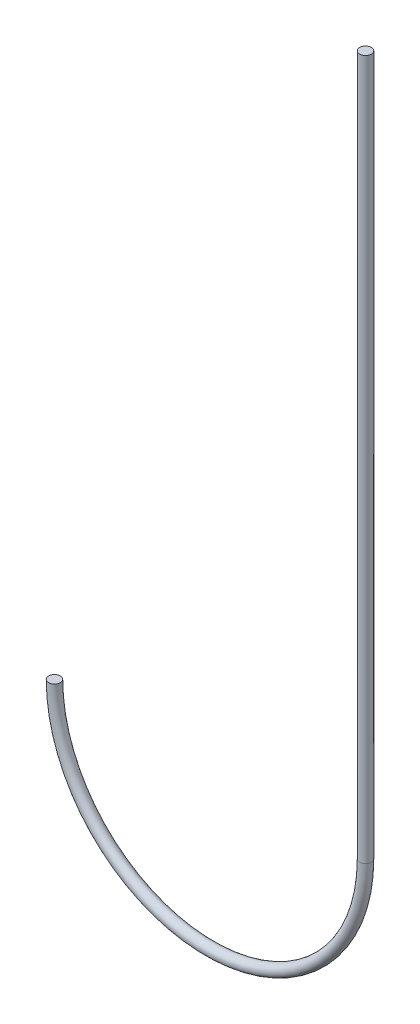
from build123d import *

# Parameters (mm, degrees)
SKIZZE2_R               = 0.75
SKIZZE2_3_R             = 0.75
LINEAR_AUSTRAGEN1_DEPTH = 90


with BuildPart() as part:
    # Austragung1: sweep along a path in Skizze1
    with BuildLine(Plane.XY) as austragung1_path:
        ThreePointArc((-20, 0), (0, -20), (20, 0))
    # Skizze2 → Austragung1 (sweep)
    with BuildSketch(Plane(origin=(0, 0, 0), x_dir=(1, 0, 0), z_dir=(0, 1, 0))):
        with Locations((20, 0)):
            Circle(SKIZZE2_R)
    sweep(path=austragung1_path.line)

    # Skizze2_3 → Linear austragen1 (add)
    with BuildSketch(Plane(origin=(0, 0, 0), x_dir=(1, 0, 0), z_dir=(0, 1, 0))):
        with Locations((20, 0)):
            Circle(SKIZZE2_3_R)
    extrude(amount=LINEAR_AUSTRAGEN1_DEPTH)


solid = part.part
